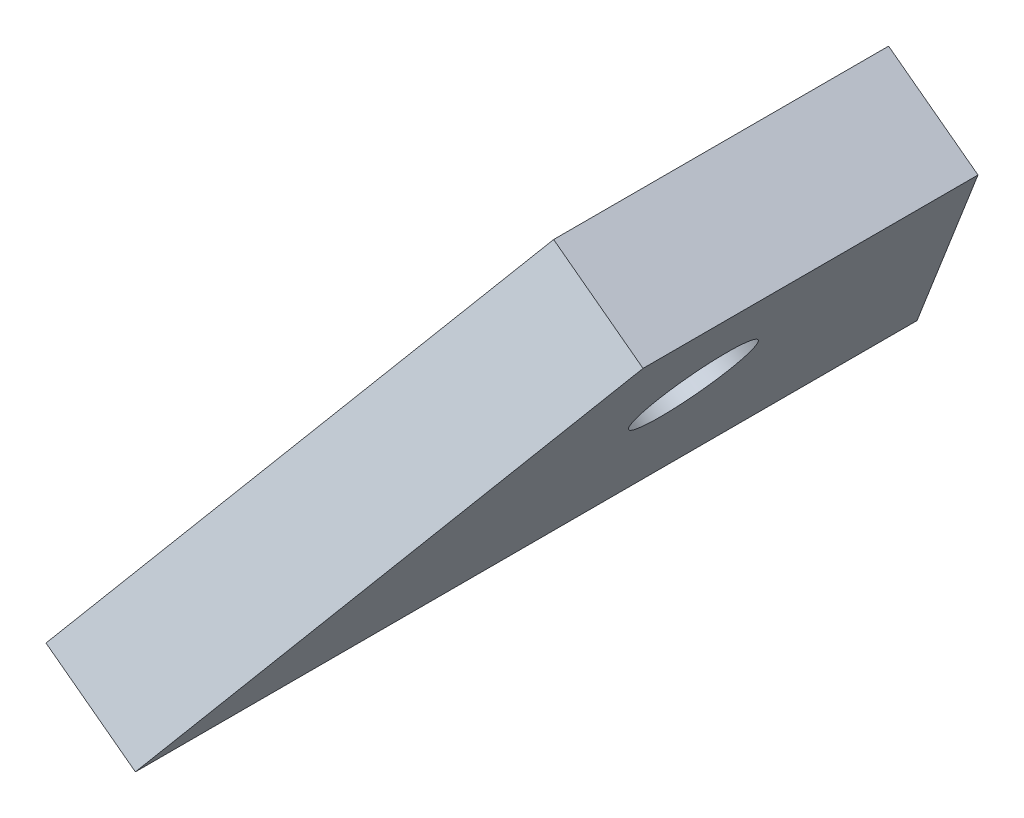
from build123d import *

# Parameters (mm, degrees)
YUGO_DEPTH          = 4
OJO_CABLE_PROFILE_R = 2


with BuildPart() as part:
    # Sk_Yugo → Yugo (new body)
    with BuildSketch(Plane(origin=(-318.901689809, 238.632958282, 0), x_dir=(0, 0, 1), z_dir=(-0.800654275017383, 0.5991266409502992, 0))):
        Polygon((-14, 203.763792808), (14, 203.763792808), (6, 220.763792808), (-6, 220.763792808), align=None)
    extrude(amount=YUGO_DEPTH)

    # Ojo_cable: sweep along a curve in space
    with BuildLine() as ojo_cable_path:
        Line((-190.029452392, 409.184726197, 0), (-194.833378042, 412.779486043, 0))
    # Ojo_cable profile (on start of the path) → Ojo_cable (sweep, cut)
    with BuildSketch(Plane(origin=(-190.029452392, 409.184726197, 0), x_dir=(-0.5991266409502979, -0.8006542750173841, 0), z_dir=(-0.8006542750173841, 0.5991266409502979, 0))):
        Circle(OJO_CABLE_PROFILE_R)
    sweep(path=ojo_cable_path.line, mode=Mode.SUBTRACT)


solid = part.part
